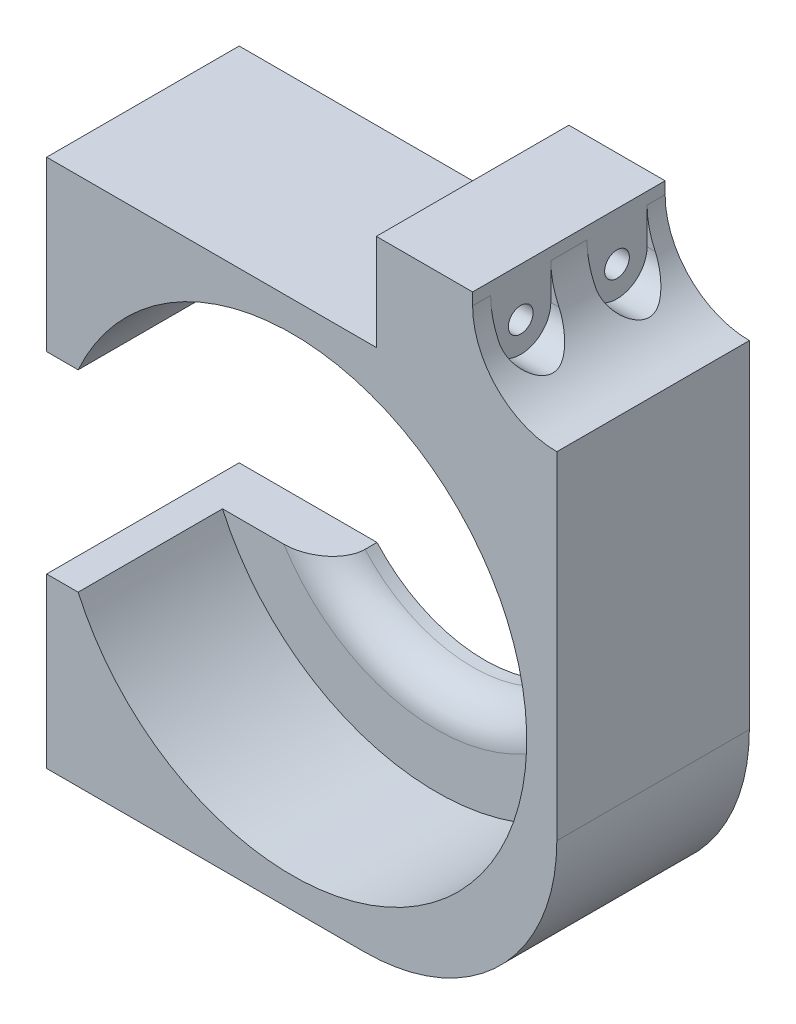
from build123d import *

# Parameters (mm, degrees)
SKETCH1_R               = 61.9125
BOSS_EXTRUDE1_DEPTH     = 50.8
SKETCH2_R               = 61.9125
SKETCH2_R_2             = 38.1
BOSS_EXTRUDE2_DEPTH     = 12.7
F_1_4_CLEARANCE_HOLE1_D = 6.5278
CUT_EXTRUDE1_DEPTH      = 279.912500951
FILLET2_R               = 9.525
SKETCH8_W               = 181.329761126
SKETCH8_H               = 181.329761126
CUT_EXTRUDE4_DEPTH      = 177.548272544
SKETCH10_W              = 97.90938014
SKETCH10_H              = 50.8
CUT_EXTRUDE5_DEPTH      = 177.548272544


with BuildPart() as part:
    # Sketch1 → Boss-Extrude1 (new body)
    with BuildSketch(Plane.XY):
        with BuildLine():
            Line((-88.9, -69.85), (88.9, -69.85))
            ThreePointArc((88.9, -69.85), (124.821024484, -54.971024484), (139.7, -19.05))
            Line((139.7, -19.05), (139.7, 69.85))
            ThreePointArc((139.7, 69.85), (123.984551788, 76.359551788), (117.475, 92.075))
            Line((117.475, 92.075), (117.475, 95.25))
            Line((117.475, 95.25), (92.075, 95.25))
            Line((92.075, 95.25), (92.075, 69.85))
            Line((92.075, 69.85), (-92.075, 69.85))
            Line((-92.075, 69.85), (-92.075, 95.25))
            Line((-92.075, 95.25), (-117.475, 95.25))
            Line((-117.475, 95.25), (-117.475, 92.075))
            ThreePointArc((-117.475, 92.075), (-123.984551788, 76.359551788), (-139.7, 69.85))
            Line((-139.7, 69.85), (-139.7, -19.05))
            ThreePointArc((-139.7, -19.05), (-124.821024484, -54.971024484), (-88.9, -69.85))
        make_face()
        with Locations((69.85, 0)):
            Circle(SKETCH1_R, mode=Mode.SUBTRACT)
        with Locations((-69.85, 0)):
            Circle(SKETCH1_R, mode=Mode.SUBTRACT)
    extrude(amount=BOSS_EXTRUDE1_DEPTH)

    # Sketch2 → Boss-Extrude2 (add)
    # profile 1 of 2: a face of its own
    with BuildSketch(Plane(origin=(0, 0, 0), x_dir=(-1, 0, 0), z_dir=(0, 0, -1))):
        with Locations((69.85, 0)):
            Circle(SKETCH2_R)
        with Locations((69.85, 0)):
            Circle(SKETCH2_R_2, mode=Mode.SUBTRACT)
    # profile 2 of 2: a face of its own
    with BuildSketch(Plane(origin=(0, 0, 0), x_dir=(-1, 0, 0), z_dir=(0, 0, -1))):
        with Locations((-69.85, 0)):
            Circle(SKETCH2_R)
        with Locations((-69.85, 0)):
            Circle(SKETCH2_R_2, mode=Mode.SUBTRACT)
    extrude(amount=-BOSS_EXTRUDE2_DEPTH)

    # 1_4 Clearance Hole1 (through all)
    with Locations(Plane(origin=(139.7, 0, 0), x_dir=(0, 0, -1), z_dir=(1, 0, 0))):
        with Locations((-12.7, 82.55), (-38.1, 82.55)):
            Hole(F_1_4_CLEARANCE_HOLE1_D / 2)

    # Sketch5 → Cut-Extrude1 (cut, through all)
    with BuildSketch(Plane(origin=(117.475, 0, 0), x_dir=(0, 0, -1), z_dir=(1, 0, 0))):
        with BuildLine():
            Line((-46.0375, 82.55), (-46.0375, 95.25))
            Line((-46.0375, 95.25), (-38.1, 95.25))
            Line((-38.1, 95.25), (-30.1625, 95.25))
            Line((-30.1625, 95.25), (-30.1625, 82.55))
            ThreePointArc((-30.1625, 82.55), (-38.1, 74.6125), (-46.0375, 82.55))
        make_face()
        with BuildLine():
            Line((-20.6375, 82.55), (-20.6375, 95.25))
            Line((-20.6375, 95.25), (-12.7, 95.25))
            Line((-12.7, 95.25), (-4.7625, 95.25))
            Line((-4.7625, 95.25), (-4.7625, 82.55))
            ThreePointArc((-4.7625, 82.55), (-12.7, 74.6125), (-20.6375, 82.55))
        make_face()
    cut_extrude1 = extrude(amount=CUT_EXTRUDE1_DEPTH, mode=Mode.SUBTRACT)

    # Mirror1: Cut-Extrude1 across plane
    add(cut_extrude1.mirror(Plane(origin=(0, 0, 0), x_dir=(0, 0, 1), z_dir=(1, 0, 0))), mode=Mode.SUBTRACT)

    # Fillet2
    fillet2_edges = [part.edges().sort_by_distance(p)[0] for p in [
        (-31.75, 0, 12.7),
        (107.95, 0, 12.7),
    ]]
    fillet(fillet2_edges, radius=FILLET2_R)

    # Sketch8 → Cut-Extrude4 (cut, through all)
    with BuildSketch(Plane(origin=(0, 0, 0), x_dir=(-1, 0, 0), z_dir=(0, 0, -1))):
        with Locations((85.584880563, 20.814880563)):
            Rectangle(SKETCH8_W, SKETCH8_H)
    extrude(amount=-CUT_EXTRUDE4_DEPTH, mode=Mode.SUBTRACT)

    # Sketch10 → Cut-Extrude5 (cut, through all)
    with BuildSketch(Plane(origin=(0, 0, 0), x_dir=(-1, 0, 0), z_dir=(0, 0, -1))):
        Rectangle(SKETCH10_W, SKETCH10_H)
    extrude(amount=-CUT_EXTRUDE5_DEPTH, mode=Mode.SUBTRACT)


solid = part.part
